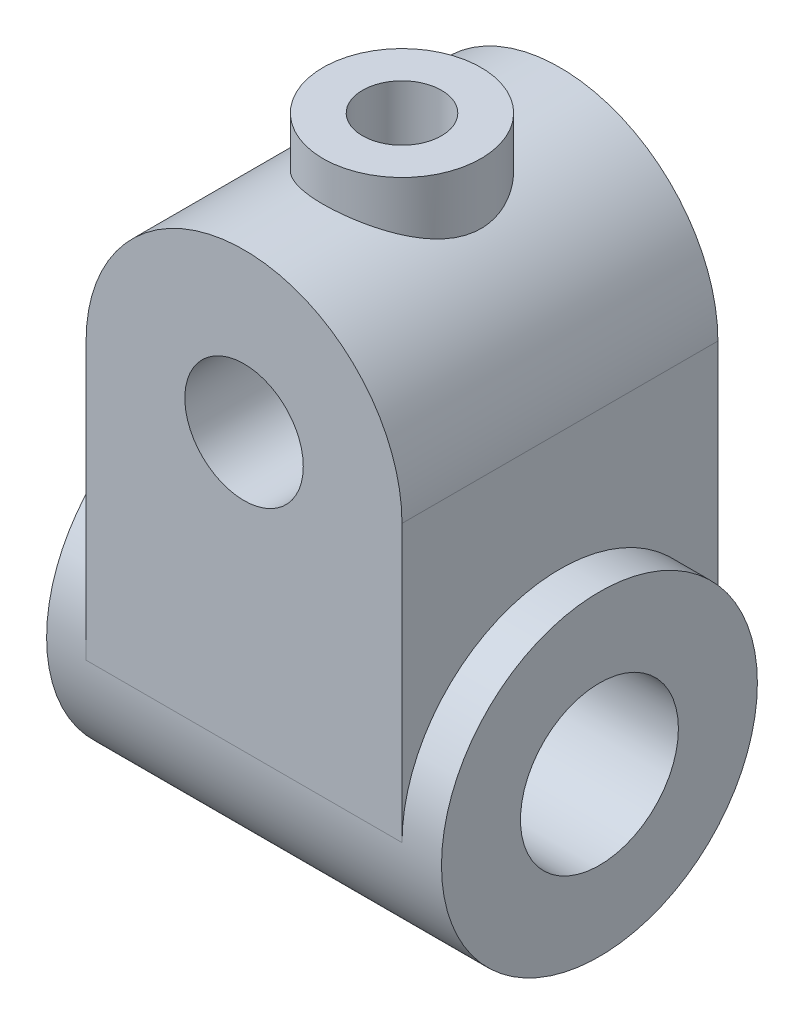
ISO-10303-21;
HEADER;
FILE_DESCRIPTION(('STEP AP214'),'2;1');
FILE_NAME('part.step','',(''),(''),'','','');
FILE_SCHEMA(('AUTOMOTIVE_DESIGN { 1 0 10303 214 1 1 1 1 }'));
ENDSEC;
DATA;
#1=APPLICATION_CONTEXT('core data for automotive mechanical design processes');
#2=APPLICATION_PROTOCOL_DEFINITION('international standard','automotive_design',2000,#1);
#3=PRODUCT_CONTEXT('',#1,'mechanical');
#4=PRODUCT('Part','Part','',(#3));
#5=PRODUCT_RELATED_PRODUCT_CATEGORY('part','',(#4));
#6=PRODUCT_DEFINITION_FORMATION('','',#4);
#7=PRODUCT_DEFINITION_CONTEXT('part definition',#1,'design');
#8=PRODUCT_DEFINITION('design','',#6,#7);
#9=PRODUCT_DEFINITION_SHAPE('','',#8);
#10=(LENGTH_UNIT() NAMED_UNIT(*) SI_UNIT(.MILLI.,.METRE.));
#11=(NAMED_UNIT(*) PLANE_ANGLE_UNIT() SI_UNIT($,.RADIAN.));
#12=(NAMED_UNIT(*) SI_UNIT($,.STERADIAN.) SOLID_ANGLE_UNIT());
#13=UNCERTAINTY_MEASURE_WITH_UNIT(LENGTH_MEASURE(1.E-05),#10,'distance_accuracy_value','');
#14=(GEOMETRIC_REPRESENTATION_CONTEXT(3) GLOBAL_UNCERTAINTY_ASSIGNED_CONTEXT((#13)) GLOBAL_UNIT_ASSIGNED_CONTEXT((#10,
#11,#12)) REPRESENTATION_CONTEXT('',''));
#15=CARTESIAN_POINT('',(0.,0.,0.));
#16=DIRECTION('',(0.,0.,1.));
#17=DIRECTION('',(1.,0.,0.));
#18=AXIS2_PLACEMENT_3D('',#15,#16,#17);
#19=CARTESIAN_POINT('',(0.,70.,40.));
#20=DIRECTION('',(1.,0.,0.));
#21=DIRECTION('',(0.,0.,-1.));
#22=AXIS2_PLACEMENT_3D('',#19,#20,#21);
#23=PLANE('',#22);
#24=CARTESIAN_POINT('',(0.,0.,0.));
#25=DIRECTION('',(1.,0.,0.));
#26=DIRECTION('',(0.,0.,-1.));
#27=AXIS2_PLACEMENT_3D('',#24,#25,#26);
#28=CIRCLE('',#27,40.);
#29=CARTESIAN_POINT('',(0.,0.,40.));
#30=VERTEX_POINT('',#29);
#31=CARTESIAN_POINT('',(0.,0.,-40.));
#32=VERTEX_POINT('',#31);
#33=EDGE_CURVE('E78',#30,#32,#28,.F.);
#34=ORIENTED_EDGE('',*,*,#33,.F.);
#35=DIRECTION('',(0.,-1.,0.));
#36=VECTOR('',#35,1.);
#37=CARTESIAN_POINT('',(0.,70.,40.));
#38=LINE('',#37,#36);
#39=CARTESIAN_POINT('',(0.,70.,40.));
#40=VERTEX_POINT('',#39);
#41=EDGE_CURVE('E89',#40,#30,#38,.T.);
#42=ORIENTED_EDGE('',*,*,#41,.F.);
#43=DIRECTION('',(0.,0.,-1.));
#44=VECTOR('',#43,1.);
#45=CARTESIAN_POINT('',(0.,70.,40.));
#46=LINE('',#45,#44);
#47=CARTESIAN_POINT('',(0.,70.,-40.));
#48=VERTEX_POINT('',#47);
#49=EDGE_CURVE('E105',#40,#48,#46,.T.);
#50=ORIENTED_EDGE('',*,*,#49,.T.);
#51=DIRECTION('',(0.,-1.,0.));
#52=VECTOR('',#51,1.);
#53=CARTESIAN_POINT('',(0.,70.,-40.));
#54=LINE('',#53,#52);
#55=EDGE_CURVE('E97',#48,#32,#54,.T.);
#56=ORIENTED_EDGE('',*,*,#55,.T.);
#57=EDGE_LOOP('',(#34,#42,#50,#56));
#58=FACE_BOUND('',#57,.T.);
#59=ADVANCED_FACE('F33',(#58),#23,.F.);
#60=CARTESIAN_POINT('',(80.,0.,40.));
#61=DIRECTION('',(-1.,0.,0.));
#62=DIRECTION('',(0.,0.,1.));
#63=AXIS2_PLACEMENT_3D('',#60,#61,#62);
#64=PLANE('',#63);
#65=CARTESIAN_POINT('',(80.,0.,0.));
#66=DIRECTION('',(-1.,0.,0.));
#67=DIRECTION('',(0.,0.,1.));
#68=AXIS2_PLACEMENT_3D('',#65,#66,#67);
#69=CIRCLE('',#68,40.);
#70=CARTESIAN_POINT('',(80.,0.,-40.));
#71=VERTEX_POINT('',#70);
#72=CARTESIAN_POINT('',(80.,0.,40.));
#73=VERTEX_POINT('',#72);
#74=EDGE_CURVE('E12',#71,#73,#69,.F.);
#75=ORIENTED_EDGE('',*,*,#74,.F.);
#76=DIRECTION('',(0.,1.,0.));
#77=VECTOR('',#76,1.);
#78=CARTESIAN_POINT('',(80.,0.,-40.));
#79=LINE('',#78,#77);
#80=CARTESIAN_POINT('',(80.,70.,-40.));
#81=VERTEX_POINT('',#80);
#82=EDGE_CURVE('E66',#71,#81,#79,.T.);
#83=ORIENTED_EDGE('',*,*,#82,.T.);
#84=DIRECTION('',(0.,0.,-1.));
#85=VECTOR('',#84,1.);
#86=CARTESIAN_POINT('',(80.,70.,40.));
#87=LINE('',#86,#85);
#88=CARTESIAN_POINT('',(80.,70.,40.));
#89=VERTEX_POINT('',#88);
#90=EDGE_CURVE('E41',#89,#81,#87,.T.);
#91=ORIENTED_EDGE('',*,*,#90,.F.);
#92=DIRECTION('',(0.,1.,0.));
#93=VECTOR('',#92,1.);
#94=CARTESIAN_POINT('',(80.,0.,40.));
#95=LINE('',#94,#93);
#96=EDGE_CURVE('E81',#73,#89,#95,.T.);
#97=ORIENTED_EDGE('',*,*,#96,.F.);
#98=EDGE_LOOP('',(#75,#83,#91,#97));
#99=FACE_BOUND('',#98,.T.);
#100=ADVANCED_FACE('F83',(#99),#64,.F.);
#101=CARTESIAN_POINT('',(40.,70.,40.));
#102=DIRECTION('',(0.,0.,1.));
#103=DIRECTION('',(1.,0.,0.));
#104=AXIS2_PLACEMENT_3D('',#101,#102,#103);
#105=PLANE('',#104);
#106=ORIENTED_EDGE('',*,*,#41,.T.);
#107=DIRECTION('',(1.,0.,0.));
#108=VECTOR('',#107,1.);
#109=CARTESIAN_POINT('',(0.,0.,40.));
#110=LINE('',#109,#108);
#111=EDGE_CURVE('E84',#30,#73,#110,.T.);
#112=ORIENTED_EDGE('',*,*,#111,.T.);
#113=ORIENTED_EDGE('',*,*,#96,.T.);
#114=CARTESIAN_POINT('',(40.,70.,40.));
#115=DIRECTION('',(0.,0.,1.));
#116=DIRECTION('',(1.,0.,0.));
#117=AXIS2_PLACEMENT_3D('',#114,#115,#116);
#118=CIRCLE('',#117,40.);
#119=EDGE_CURVE('E49',#89,#40,#118,.T.);
#120=ORIENTED_EDGE('',*,*,#119,.T.);
#121=EDGE_LOOP('',(#106,#112,#113,#120));
#122=FACE_BOUND('',#121,.T.);
#123=CARTESIAN_POINT('',(40.,70.,40.));
#124=DIRECTION('',(0.,0.,1.));
#125=DIRECTION('',(1.,0.,0.));
#126=AXIS2_PLACEMENT_3D('',#123,#124,#125);
#127=CIRCLE('',#126,15.);
#128=CARTESIAN_POINT('',(55.,70.,40.));
#129=VERTEX_POINT('',#128);
#130=EDGE_CURVE('E100',#129,#129,#127,.T.);
#131=ORIENTED_EDGE('',*,*,#130,.F.);
#132=EDGE_LOOP('',(#131));
#133=FACE_BOUND('',#132,.T.);
#134=ADVANCED_FACE('F87',(#122,#133),#105,.T.);
#135=CARTESIAN_POINT('',(40.,70.,-40.));
#136=DIRECTION('',(0.,0.,1.));
#137=DIRECTION('',(1.,0.,0.));
#138=AXIS2_PLACEMENT_3D('',#135,#136,#137);
#139=PLANE('',#138);
#140=ORIENTED_EDGE('',*,*,#55,.F.);
#141=CARTESIAN_POINT('',(40.,70.,-40.));
#142=DIRECTION('',(0.,0.,1.));
#143=DIRECTION('',(1.,0.,0.));
#144=AXIS2_PLACEMENT_3D('',#141,#142,#143);
#145=CIRCLE('',#144,40.);
#146=EDGE_CURVE('E71',#81,#48,#145,.T.);
#147=ORIENTED_EDGE('',*,*,#146,.F.);
#148=ORIENTED_EDGE('',*,*,#82,.F.);
#149=DIRECTION('',(1.,0.,0.));
#150=VECTOR('',#149,1.);
#151=CARTESIAN_POINT('',(0.,0.,-40.));
#152=LINE('',#151,#150);
#153=EDGE_CURVE('E94',#32,#71,#152,.T.);
#154=ORIENTED_EDGE('',*,*,#153,.F.);
#155=EDGE_LOOP('',(#140,#147,#148,#154));
#156=FACE_BOUND('',#155,.T.);
#157=CARTESIAN_POINT('',(40.,70.,-40.));
#158=DIRECTION('',(0.,0.,1.));
#159=DIRECTION('',(1.,0.,0.));
#160=AXIS2_PLACEMENT_3D('',#157,#158,#159);
#161=CIRCLE('',#160,15.);
#162=CARTESIAN_POINT('',(55.,70.,-40.));
#163=VERTEX_POINT('',#162);
#164=EDGE_CURVE('E111',#163,#163,#161,.T.);
#165=ORIENTED_EDGE('',*,*,#164,.T.);
#166=EDGE_LOOP('',(#165));
#167=FACE_BOUND('',#166,.T.);
#168=ADVANCED_FACE('F107',(#156,#167),#139,.F.);
#169=CARTESIAN_POINT('',(40.,70.,40.));
#170=DIRECTION('',(0.,0.,-1.));
#171=DIRECTION('',(-1.,0.,0.));
#172=AXIS2_PLACEMENT_3D('',#169,#170,#171);
#173=CYLINDRICAL_SURFACE('',#172,40.);
#174=CARTESIAN_POINT('',(40.,109.999999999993,20.));
#175=CARTESIAN_POINT('',(40.5259554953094,109.999998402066,19.9999982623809));
#176=CARTESIAN_POINT('',(41.0519477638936,109.989602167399,19.9792289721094));
#177=CARTESIAN_POINT('',(42.1000584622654,109.948279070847,19.8963883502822));
#178=CARTESIAN_POINT('',(42.6221751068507,109.917343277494,19.8342990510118));
#179=CARTESIAN_POINT('',(43.6592645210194,109.835672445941,19.6694161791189));
#180=CARTESIAN_POINT('',(44.1742237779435,109.784904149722,19.5665542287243));
#181=CARTESIAN_POINT('',(45.1923636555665,109.664872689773,19.3213235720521));
#182=CARTESIAN_POINT('',(45.695545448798,109.595611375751,19.1789588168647));
#183=CARTESIAN_POINT('',(46.6849367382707,109.440606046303,18.856861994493));
#184=CARTESIAN_POINT('',(47.1712049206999,109.354927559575,18.6772782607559));
#185=CARTESIAN_POINT('',(48.1259686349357,109.168931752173,18.2821113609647));
#186=CARTESIAN_POINT('',(48.5944637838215,109.068614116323,18.0665274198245));
#187=CARTESIAN_POINT('',(49.5110978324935,108.855635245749,17.6012260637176));
#188=CARTESIAN_POINT('',(49.9592411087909,108.742976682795,17.3515160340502));
#189=CARTESIAN_POINT('',(50.8331914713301,108.507749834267,16.8197401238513));
#190=CARTESIAN_POINT('',(51.2589965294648,108.385180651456,16.5376713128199));
#191=CARTESIAN_POINT('',(52.111428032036,108.125105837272,15.9249873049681));
#192=CARTESIAN_POINT('',(52.5365475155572,107.987145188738,15.5924680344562));
#193=CARTESIAN_POINT('',(53.3576238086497,107.706261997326,14.8951014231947));
#194=CARTESIAN_POINT('',(53.7535796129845,107.563339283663,14.5302529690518));
#195=CARTESIAN_POINT('',(54.5147245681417,107.275841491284,13.7699763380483));
#196=CARTESIAN_POINT('',(54.8798984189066,107.131265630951,13.3745331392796));
#197=CARTESIAN_POINT('',(55.5776736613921,106.843975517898,12.5549154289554));
#198=CARTESIAN_POINT('',(55.9102597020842,106.701262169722,12.1307275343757));
#199=CARTESIAN_POINT('',(56.5654339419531,106.410501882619,11.2215973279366));
#200=CARTESIAN_POINT('',(56.8852333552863,106.262903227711,10.7344956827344));
#201=CARTESIAN_POINT('',(57.4822019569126,105.978908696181,9.7320475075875));
#202=CARTESIAN_POINT('',(57.7593921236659,105.842507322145,9.21671504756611));
#203=CARTESIAN_POINT('',(58.268775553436,105.58557632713,8.16060160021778));
#204=CARTESIAN_POINT('',(58.50098089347,105.465042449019,7.61982749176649));
#205=CARTESIAN_POINT('',(58.9178904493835,105.244419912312,6.51622809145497));
#206=CARTESIAN_POINT('',(59.1025999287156,105.144328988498,5.95340525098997));
#207=CARTESIAN_POINT('',(59.4125091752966,104.974045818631,4.8441699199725));
#208=CARTESIAN_POINT('',(59.5406061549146,104.902424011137,4.29878748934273));
#209=CARTESIAN_POINT('',(59.7508644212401,104.783875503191,3.19656707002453));
#210=CARTESIAN_POINT('',(59.8330276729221,104.736947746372,2.63972957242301));
#211=CARTESIAN_POINT('',(59.9500955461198,104.669846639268,1.51997079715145));
#212=CARTESIAN_POINT('',(59.9850401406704,104.649650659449,0.957055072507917));
#213=CARTESIAN_POINT('',(60.007216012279,104.636851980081,-0.170005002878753));
#214=CARTESIAN_POINT('',(59.9944518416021,104.644246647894,-0.734149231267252));
#215=CARTESIAN_POINT('',(59.9258258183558,104.683752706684,-1.79091472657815));
#216=CARTESIAN_POINT('',(59.8753086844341,104.712797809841,-2.28400999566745));
#217=CARTESIAN_POINT('',(59.7381397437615,104.790976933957,-3.26348526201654));
#218=CARTESIAN_POINT('',(59.6514913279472,104.840109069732,-3.74986588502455));
#219=CARTESIAN_POINT('',(59.4430371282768,104.95686683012,-4.71286681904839));
#220=CARTESIAN_POINT('',(59.3212225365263,105.024497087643,-5.18948465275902));
#221=CARTESIAN_POINT('',(59.0437058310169,105.176160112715,-6.13006796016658));
#222=CARTESIAN_POINT('',(58.8880019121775,105.260193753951,-6.59403275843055));
#223=CARTESIAN_POINT('',(58.5401581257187,105.444352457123,-7.51741518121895));
#224=CARTESIAN_POINT('',(58.3472621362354,105.54480336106,-7.97648237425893));
#225=CARTESIAN_POINT('',(57.9289653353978,105.757618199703,-8.87686508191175));
#226=CARTESIAN_POINT('',(57.7035528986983,105.86998639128,-9.31817417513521));
#227=CARTESIAN_POINT('',(57.221745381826,106.103783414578,-10.1811473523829));
#228=CARTESIAN_POINT('',(56.9653434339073,106.225214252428,-10.6028070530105));
#229=CARTESIAN_POINT('',(56.423079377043,106.474257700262,-11.4247489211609));
#230=CARTESIAN_POINT('',(56.137218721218,106.601870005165,-11.8250321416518));
#231=CARTESIAN_POINT('',(55.4992958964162,106.876920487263,-12.6521986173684));
#232=CARTESIAN_POINT('',(55.1434365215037,107.024818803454,-13.0760069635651));
#233=CARTESIAN_POINT('',(54.3979314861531,107.321045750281,-13.8926336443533));
#234=CARTESIAN_POINT('',(54.0082842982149,107.469374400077,-14.2854505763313));
#235=CARTESIAN_POINT('',(53.1968254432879,107.762812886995,-15.0382941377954));
#236=CARTESIAN_POINT('',(52.7749919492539,107.907920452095,-15.3982981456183));
#237=CARTESIAN_POINT('',(51.9015900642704,108.191135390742,-16.0829073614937));
#238=CARTESIAN_POINT('',(51.4500336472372,108.329245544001,-16.4075266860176));
#239=CARTESIAN_POINT('',(50.4974553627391,108.60129606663,-17.0335917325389));
#240=CARTESIAN_POINT('',(49.9951074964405,108.734738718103,-17.3332416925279));
#241=CARTESIAN_POINT('',(48.963059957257,108.986480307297,-17.8887384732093));
#242=CARTESIAN_POINT('',(48.4333590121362,109.104778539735,-18.1445832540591));
#243=CARTESIAN_POINT('',(47.3505204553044,109.32269846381,-18.6095886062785));
#244=CARTESIAN_POINT('',(46.7973980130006,109.42233202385,-18.818778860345));
#245=CARTESIAN_POINT('',(45.6716452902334,109.599962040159,-19.1881015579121));
#246=CARTESIAN_POINT('',(45.0990172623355,109.677960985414,-19.3482396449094));
#247=CARTESIAN_POINT('',(43.9872016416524,109.804382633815,-19.6061317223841));
#248=CARTESIAN_POINT('',(43.4491731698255,109.854720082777,-19.7079544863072));
#249=CARTESIAN_POINT('',(42.3650118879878,109.93372050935,-19.8672303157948));
#250=CARTESIAN_POINT('',(41.8188795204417,109.962384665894,-19.9246857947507));
#251=CARTESIAN_POINT('',(40.7232429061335,109.997215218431,-19.9944526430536));
#252=CARTESIAN_POINT('',(40.1737400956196,110.003390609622,-20.0067820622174));
#253=CARTESIAN_POINT('',(39.0758094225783,109.993089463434,-19.9861776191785));
#254=CARTESIAN_POINT('',(38.5273815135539,109.976613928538,-19.9532457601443));
#255=CARTESIAN_POINT('',(37.4786084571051,109.923634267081,-19.8468758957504));
#256=CARTESIAN_POINT('',(36.9778357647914,109.888784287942,-19.7767809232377));
#257=CARTESIAN_POINT('',(35.9845932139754,109.801068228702,-19.5992599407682));
#258=CARTESIAN_POINT('',(35.492122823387,109.748203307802,-19.4918363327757));
#259=CARTESIAN_POINT('',(34.5186314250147,109.625690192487,-19.2407722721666));
#260=CARTESIAN_POINT('',(34.0376110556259,109.556041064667,-19.0971298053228));
#261=CARTESIAN_POINT('',(33.0898970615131,109.401535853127,-18.7750097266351));
#262=CARTESIAN_POINT('',(32.6232040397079,109.316679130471,-18.5965306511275));
#263=CARTESIAN_POINT('',(31.6936008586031,109.130994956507,-18.2007191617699));
#264=CARTESIAN_POINT('',(31.2311785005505,109.029780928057,-17.9824235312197));
#265=CARTESIAN_POINT('',(30.326550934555,108.815467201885,-17.5124022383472));
#266=CARTESIAN_POINT('',(29.8843459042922,108.702367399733,-17.2606762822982));
#267=CARTESIAN_POINT('',(29.0220526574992,108.46666770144,-16.7254970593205));
#268=CARTESIAN_POINT('',(28.6019713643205,108.34406486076,-16.4420339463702));
#269=CARTESIAN_POINT('',(27.7858181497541,108.091944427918,-15.8451696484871));
#270=CARTESIAN_POINT('',(27.3897483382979,107.962426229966,-15.5317658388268));
#271=CARTESIAN_POINT('',(26.5855515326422,107.686212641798,-14.8444984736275));
#272=CARTESIAN_POINT('',(26.1800620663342,107.539079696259,-14.4677200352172));
#273=CARTESIAN_POINT('',(25.4019120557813,107.243376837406,-13.6821610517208));
#274=CARTESIAN_POINT('',(25.0292535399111,107.094806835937,-13.2733785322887));
#275=CARTESIAN_POINT('',(24.3185097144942,106.799985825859,-12.425656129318));
#276=CARTESIAN_POINT('',(23.9804398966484,106.653735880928,-11.9867028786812));
#277=CARTESIAN_POINT('',(23.3408603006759,106.367511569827,-11.0806458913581));
#278=CARTESIAN_POINT('',(23.0393678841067,106.227540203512,-10.6135289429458));
#279=CARTESIAN_POINT('',(22.4614329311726,105.951442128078,-9.63013638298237));
#280=CARTESIAN_POINT('',(22.186924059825,105.815834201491,-9.11257468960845));
#281=CARTESIAN_POINT('',(21.6832269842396,105.560870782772,-8.05233179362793));
#282=CARTESIAN_POINT('',(21.4540134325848,105.441506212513,-7.5096648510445));
#283=CARTESIAN_POINT('',(21.0434464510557,105.223615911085,-6.4029008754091));
#284=CARTESIAN_POINT('',(20.8620564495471,105.125074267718,-5.83882059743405));
#285=CARTESIAN_POINT('',(20.5493981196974,104.952912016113,-4.69323340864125));
#286=CARTESIAN_POINT('',(20.4181220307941,104.87928754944,-4.1117292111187));
#287=CARTESIAN_POINT('',(20.2178487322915,104.766052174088,-2.99295044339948));
#288=CARTESIAN_POINT('',(20.1440828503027,104.723854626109,-2.45678849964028));
#289=CARTESIAN_POINT('',(20.0402461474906,104.664273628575,-1.37887867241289));
#290=CARTESIAN_POINT('',(20.0101723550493,104.646888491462,-0.837131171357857));
#291=CARTESIAN_POINT('',(19.9941806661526,104.63765684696,0.247027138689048));
#292=CARTESIAN_POINT('',(20.0082464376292,104.645800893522,0.789437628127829));
#293=CARTESIAN_POINT('',(20.0802820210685,104.687267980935,1.87034420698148));
#294=CARTESIAN_POINT('',(20.138250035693,104.720589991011,2.40884045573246));
#295=CARTESIAN_POINT('',(20.2896203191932,104.806718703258,3.42632818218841));
#296=CARTESIAN_POINT('',(20.3791121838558,104.85736196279,3.90609324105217));
#297=CARTESIAN_POINT('',(20.592285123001,104.976499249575,4.85565155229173));
#298=CARTESIAN_POINT('',(20.715963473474,105.044991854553,5.32544559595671));
#299=CARTESIAN_POINT('',(20.9962842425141,105.197787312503,6.25246548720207));
#300=CARTESIAN_POINT('',(21.1529293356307,105.282091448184,6.70969031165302));
#301=CARTESIAN_POINT('',(21.4978706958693,105.464196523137,7.60943192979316));
#302=CARTESIAN_POINT('',(21.6861786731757,105.562002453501,8.05194320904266));
#303=CARTESIAN_POINT('',(22.1066410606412,105.775507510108,8.94926640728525));
#304=CARTESIAN_POINT('',(22.3408874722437,105.891966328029,9.40291703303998));
#305=CARTESIAN_POINT('',(22.8421088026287,106.134252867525,10.2891181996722));
#306=CARTESIAN_POINT('',(23.1090845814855,106.260080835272,10.7216681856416));
#307=CARTESIAN_POINT('',(23.6743412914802,106.518069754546,11.5641839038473));
#308=CARTESIAN_POINT('',(23.9726401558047,106.650234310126,11.974136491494));
#309=CARTESIAN_POINT('',(24.5988193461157,106.917739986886,12.7694857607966));
#310=CARTESIAN_POINT('',(24.926692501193,107.053080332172,13.1548883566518));
#311=CARTESIAN_POINT('',(25.6523225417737,107.340519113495,13.9451011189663));
#312=CARTESIAN_POINT('',(26.053727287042,107.492651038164,14.3465583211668));
#313=CARTESIAN_POINT('',(26.8899970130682,107.793190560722,15.114567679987));
#314=CARTESIAN_POINT('',(27.324864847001,107.941597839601,15.4811168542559));
#315=CARTESIAN_POINT('',(28.2261325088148,108.230879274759,16.1771564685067));
#316=CARTESIAN_POINT('',(28.6925508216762,108.371748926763,16.5066248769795));
#317=CARTESIAN_POINT('',(29.654209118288,108.642127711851,17.1257582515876));
#318=CARTESIAN_POINT('',(30.1494474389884,108.771637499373,17.4154255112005));
#319=CARTESIAN_POINT('',(31.1695552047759,109.016667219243,17.9543405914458));
#320=CARTESIAN_POINT('',(31.6946112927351,109.132080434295,18.2032844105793));
#321=CARTESIAN_POINT('',(32.7677039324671,109.344542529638,18.6556405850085));
#322=CARTESIAN_POINT('',(33.315743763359,109.441588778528,18.859046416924));
#323=CARTESIAN_POINT('',(34.4292109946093,109.614175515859,19.2173750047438));
#324=CARTESIAN_POINT('',(34.9945911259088,109.689769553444,19.3724185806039));
#325=CARTESIAN_POINT('',(36.1390535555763,109.817385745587,19.6325521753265));
#326=CARTESIAN_POINT('',(36.7181272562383,109.869422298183,19.737672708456));
#327=CARTESIAN_POINT('',(37.7478329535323,109.939055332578,19.8778978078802));
#328=CARTESIAN_POINT('',(38.1966966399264,109.961869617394,19.9236469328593));
#329=CARTESIAN_POINT('',(39.0970311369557,109.992342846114,19.9846991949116));
#330=CARTESIAN_POINT('',(39.5485020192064,110.000001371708,20.000001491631));
#331=CARTESIAN_POINT('',(40.,109.999999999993,20.));
#332=B_SPLINE_CURVE_WITH_KNOTS('',3,(#174,#175,#176,#177,#178,#179,#180,#181,#182,#183,#184,
#185,#186,#187,#188,#189,#190,#191,#192,#193,#194,#195,#196,#197,#198,#199,#200,#201,#202,#203,
#204,#205,#206,#207,#208,#209,#210,#211,#212,#213,#214,#215,#216,#217,#218,#219,#220,#221,#222,
#223,#224,#225,#226,#227,#228,#229,#230,#231,#232,#233,#234,#235,#236,#237,#238,#239,#240,#241,
#242,#243,#244,#245,#246,#247,#248,#249,#250,#251,#252,#253,#254,#255,#256,#257,#258,#259,#260,
#261,#262,#263,#264,#265,#266,#267,#268,#269,#270,#271,#272,#273,#274,#275,#276,#277,#278,#279,
#280,#281,#282,#283,#284,#285,#286,#287,#288,#289,#290,#291,#292,#293,#294,#295,#296,#297,#298,
#299,#300,#301,#302,#303,#304,#305,#306,#307,#308,#309,#310,#311,#312,#313,#314,#315,#316,#317,
#318,#319,#320,#321,#322,#323,#324,#325,#326,#327,#328,#329,#330,#331),.UNSPECIFIED.,.T.,.F.,(4,
2,2,2,2,2,2,2,2,2,2,2,2,2,2,2,2,2,2,2,2,2,2,2,2,2,2,2,2,2,2,2,2,2,2,2,2,2,2,2,2,2,2,2,2,2,2,2,2,
2,2,2,2,2,2,2,2,2,2,2,2,2,2,2,2,2,2,2,2,2,2,2,2,2,2,2,2,2,4),(0.,1.57742117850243,
3.15552873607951,4.73629413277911,6.31690147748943,7.89132656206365,9.4657855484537,
11.0399043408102,12.6141658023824,14.2836111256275,15.9531139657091,17.6234417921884,
19.2945527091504,21.0956182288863,22.8957941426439,24.6954860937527,26.4949785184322,
28.1869064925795,29.878762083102,31.5691845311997,33.2594456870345,34.7472712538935,
36.2349572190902,37.7230161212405,39.2111543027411,40.7335431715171,42.2564776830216,
43.7797503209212,45.3029478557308,47.0195294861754,48.7361887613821,50.4540227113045,
52.1711688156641,53.9686851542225,55.7662851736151,57.5627382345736,59.3589845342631,
61.0064389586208,62.6538037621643,64.3005095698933,65.9471425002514,67.4659444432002,
68.9846486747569,70.5034373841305,72.0222899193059,73.5844756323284,75.1466750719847,
76.7093605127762,78.2721830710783,79.9885258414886,81.7049745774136,83.4221887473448,
85.1402148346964,86.9418674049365,88.7425088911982,90.5417693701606,92.3407511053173,
93.9670431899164,95.5932246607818,97.218804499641,98.8443177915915,100.31467320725,
101.784911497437,103.255269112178,104.726171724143,106.295593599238,107.865056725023,
109.435423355,111.005410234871,112.766606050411,114.527952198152,116.290339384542,
118.052624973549,119.827518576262,121.602666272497,123.373343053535,125.142936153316,
126.49701045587,127.851122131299),.UNSPECIFIED.);
#333=CARTESIAN_POINT('',(40.,109.999999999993,20.));
#334=VERTEX_POINT('',#333);
#335=EDGE_CURVE('E130',#334,#334,#332,.T.);
#336=ORIENTED_EDGE('',*,*,#335,.F.);
#337=EDGE_LOOP('',(#336));
#338=FACE_BOUND('',#337,.T.);
#339=ORIENTED_EDGE('',*,*,#146,.T.);
#340=ORIENTED_EDGE('',*,*,#49,.F.);
#341=ORIENTED_EDGE('',*,*,#119,.F.);
#342=ORIENTED_EDGE('',*,*,#90,.T.);
#343=EDGE_LOOP('',(#339,#340,#341,#342));
#344=FACE_BOUND('',#343,.T.);
#345=ADVANCED_FACE('F106',(#338,#344),#173,.T.);
#346=CARTESIAN_POINT('',(40.,70.,40.));
#347=DIRECTION('',(0.,0.,-1.));
#348=DIRECTION('',(-1.,0.,0.));
#349=AXIS2_PLACEMENT_3D('',#346,#347,#348);
#350=CYLINDRICAL_SURFACE('',#349,15.);
#351=CARTESIAN_POINT('',(40.,85.,9.99999999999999));
#352=CARTESIAN_POINT('',(40.251216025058,84.9999999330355,9.9999999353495));
#353=CARTESIAN_POINT('',(40.5024332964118,84.9936756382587,9.99052094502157));
#354=CARTESIAN_POINT('',(41.0028143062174,84.968537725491,9.95275435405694));
#355=CARTESIAN_POINT('',(41.2519780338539,84.949724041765,9.92446665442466));
#356=CARTESIAN_POINT('',(41.7463943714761,84.900062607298,9.84950014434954));
#357=CARTESIAN_POINT('',(41.9916454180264,84.8692101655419,9.80281416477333));
#358=CARTESIAN_POINT('',(42.476368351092,84.7962049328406,9.69171976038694));
#359=CARTESIAN_POINT('',(42.7158401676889,84.7540520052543,9.62731112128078));
#360=CARTESIAN_POINT('',(43.1863415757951,84.6596225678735,9.48196024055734));
#361=CARTESIAN_POINT('',(43.4174060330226,84.6073953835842,9.40109845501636));
#362=CARTESIAN_POINT('',(43.8710353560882,84.4937836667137,9.22357931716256));
#363=CARTESIAN_POINT('',(44.0936002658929,84.4323991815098,9.12692204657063));
#364=CARTESIAN_POINT('',(44.5291923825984,84.3016824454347,8.91878234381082));
#365=CARTESIAN_POINT('',(44.7422211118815,84.2323514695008,8.80730228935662));
#366=CARTESIAN_POINT('',(45.1580689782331,84.0869750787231,8.57039192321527));
#367=CARTESIAN_POINT('',(45.3608842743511,84.0109271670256,8.44495641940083));
#368=CARTESIAN_POINT('',(45.772291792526,83.846795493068,8.16988010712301));
#369=CARTESIAN_POINT('',(45.9799261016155,83.7582376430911,8.01908981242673));
#370=CARTESIAN_POINT('',(46.3818623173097,83.5764689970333,7.70306611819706));
#371=CARTESIAN_POINT('',(46.576158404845,83.4832562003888,7.53782648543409));
#372=CARTESIAN_POINT('',(46.9510916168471,83.2938516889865,7.19355182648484));
#373=CARTESIAN_POINT('',(47.1317102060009,83.1976561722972,7.01449872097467));
#374=CARTESIAN_POINT('',(47.4784934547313,83.0042893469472,6.6435373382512));
#375=CARTESIAN_POINT('',(47.6446627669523,82.9071183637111,6.45163323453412));
#376=CARTESIAN_POINT('',(47.9872708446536,82.6984183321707,6.02411381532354));
#377=CARTESIAN_POINT('',(48.1611793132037,82.5870482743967,5.78638467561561));
#378=CARTESIAN_POINT('',(48.4882438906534,82.3688469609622,5.29498288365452));
#379=CARTESIAN_POINT('',(48.6413952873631,82.2620167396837,5.04130663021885));
#380=CARTESIAN_POINT('',(48.925545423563,82.0567536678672,4.51916377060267));
#381=CARTESIAN_POINT('',(49.0565798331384,81.958307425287,4.25072192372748));
#382=CARTESIAN_POINT('',(49.2953668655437,81.7736552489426,3.69950149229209));
#383=CARTESIAN_POINT('',(49.4031186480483,81.6874497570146,3.41672239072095));
#384=CARTESIAN_POINT('',(49.566030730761,81.554164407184,2.92197512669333));
#385=CARTESIAN_POINT('',(49.6273926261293,81.5029747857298,2.71313958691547));
#386=CARTESIAN_POINT('',(49.7367294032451,81.4105753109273,2.289937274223));
#387=CARTESIAN_POINT('',(49.784712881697,81.3693590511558,2.07557415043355));
#388=CARTESIAN_POINT('',(49.8666311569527,81.2983421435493,1.64258097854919));
#389=CARTESIAN_POINT('',(49.9005833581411,81.2685273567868,1.42395657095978));
#390=CARTESIAN_POINT('',(49.9539809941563,81.221387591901,0.983588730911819));
#391=CARTESIAN_POINT('',(49.9734263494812,81.204062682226,0.761845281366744));
#392=CARTESIAN_POINT('',(49.9975094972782,81.1825789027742,0.315986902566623));
#393=CARTESIAN_POINT('',(50.0020856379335,81.1784748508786,0.0918659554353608));
#394=CARTESIAN_POINT('',(49.9961699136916,81.1837650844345,-0.356015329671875));
#395=CARTESIAN_POINT('',(49.9856779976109,81.1931594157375,-0.579775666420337));
#396=CARTESIAN_POINT('',(49.9498102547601,81.2250543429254,-1.02531254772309));
#397=CARTESIAN_POINT('',(49.9244233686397,81.2475646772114,-1.24708749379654));
#398=CARTESIAN_POINT('',(49.8592009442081,81.3047790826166,-1.68688746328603));
#399=CARTESIAN_POINT('',(49.8193651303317,81.3394833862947,-1.90491241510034));
#400=CARTESIAN_POINT('',(49.7279332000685,81.4180019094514,-2.32630776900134));
#401=CARTESIAN_POINT('',(49.6769396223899,81.4613417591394,-2.52989845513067));
#402=CARTESIAN_POINT('',(49.5629080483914,81.5566568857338,-2.93162712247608));
#403=CARTESIAN_POINT('',(49.4998659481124,81.6086351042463,-3.12976321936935));
#404=CARTESIAN_POINT('',(49.2935449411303,81.7754502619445,-3.71496532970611));
#405=CARTESIAN_POINT('',(49.1330236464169,81.9012104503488,-4.09304089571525));
#406=CARTESIAN_POINT('',(48.8427215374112,82.1171285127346,-4.67614375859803));
#407=CARTESIAN_POINT('',(48.7261278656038,82.2015387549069,-4.89016265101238));
#408=CARTESIAN_POINT('',(48.4785240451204,82.3748717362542,-5.30787405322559));
#409=CARTESIAN_POINT('',(48.3475125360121,82.4637949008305,-5.51156558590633));
#410=CARTESIAN_POINT('',(48.0715274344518,82.6442740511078,-5.90837865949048));
#411=CARTESIAN_POINT('',(47.9265385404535,82.7358328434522,-6.10148824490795));
#412=CARTESIAN_POINT('',(47.6231772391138,82.9196994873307,-6.4765218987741));
#413=CARTESIAN_POINT('',(47.4648041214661,83.0120073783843,-6.65844537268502));
#414=CARTESIAN_POINT('',(47.099474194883,83.2155248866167,-7.04865159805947));
#415=CARTESIAN_POINT('',(46.8894079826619,83.3265151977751,-7.25415168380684));
#416=CARTESIAN_POINT('',(46.4507338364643,83.5442982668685,-7.64687567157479));
#417=CARTESIAN_POINT('',(46.2221225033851,83.6510902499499,-7.83409620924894));
#418=CARTESIAN_POINT('',(45.7473430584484,83.8576700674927,-8.18875916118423));
#419=CARTESIAN_POINT('',(45.5011880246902,83.9574630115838,-8.35621606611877));
#420=CARTESIAN_POINT('',(44.9922367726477,84.1474838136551,-8.66988260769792));
#421=CARTESIAN_POINT('',(44.7294451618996,84.2377143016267,-8.81609809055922));
#422=CARTESIAN_POINT('',(44.241665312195,84.3895846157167,-9.05909913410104));
#423=CARTESIAN_POINT('',(44.0193627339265,84.4533619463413,-9.15995597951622));
#424=CARTESIAN_POINT('',(43.5659086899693,84.5718625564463,-9.34581764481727));
#425=CARTESIAN_POINT('',(43.3347588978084,84.626587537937,-9.43082544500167));
#426=CARTESIAN_POINT('',(42.8649613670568,84.7258138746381,-9.58399689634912));
#427=CARTESIAN_POINT('',(42.6263185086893,84.7703217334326,-9.65217126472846));
#428=CARTESIAN_POINT('',(42.1428771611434,84.8481652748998,-9.77087619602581));
#429=CARTESIAN_POINT('',(41.8980785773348,84.88150078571,-9.82140648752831));
#430=CARTESIAN_POINT('',(41.4029865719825,84.9363289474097,-9.90428665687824));
#431=CARTESIAN_POINT('',(41.1526737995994,84.9577691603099,-9.93655604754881));
#432=CARTESIAN_POINT('',(40.6495599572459,84.988047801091,-9.98207727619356));
#433=CARTESIAN_POINT('',(40.3967588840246,84.9968862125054,-9.99532908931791));
#434=CARTESIAN_POINT('',(39.8907676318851,85.0017358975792,-10.0026040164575));
#435=CARTESIAN_POINT('',(39.6375774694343,84.9977476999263,-9.99662792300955));
#436=CARTESIAN_POINT('',(39.132909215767,84.9770466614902,-9.96554372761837));
#437=CARTESIAN_POINT('',(38.881431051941,84.9603343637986,-9.94043644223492));
#438=CARTESIAN_POINT('',(38.3997891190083,84.9162207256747,-9.87391563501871));
#439=CARTESIAN_POINT('',(38.1693709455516,84.8896545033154,-9.83377417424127));
#440=CARTESIAN_POINT('',(37.713249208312,84.8264553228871,-9.73781705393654));
#441=CARTESIAN_POINT('',(37.4875453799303,84.7898229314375,-9.68200227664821));
#442=CARTESIAN_POINT('',(37.0421794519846,84.7072292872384,-9.55535953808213));
#443=CARTESIAN_POINT('',(36.8225167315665,84.6612689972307,-9.48453312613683));
#444=CARTESIAN_POINT('',(36.390239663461,84.5608685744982,-9.3285826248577));
#445=CARTESIAN_POINT('',(36.1776280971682,84.5064251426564,-9.24345297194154));
#446=CARTESIAN_POINT('',(35.7479096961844,84.3865364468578,-9.05417659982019));
#447=CARTESIAN_POINT('',(35.5313009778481,84.3206265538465,-8.94919430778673));
#448=CARTESIAN_POINT('',(35.1079180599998,84.1815800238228,-8.72496139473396));
#449=CARTESIAN_POINT('',(34.9011480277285,84.1084403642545,-8.60570480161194));
#450=CARTESIAN_POINT('',(34.4981545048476,83.9562209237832,-8.3538120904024));
#451=CARTESIAN_POINT('',(34.3019336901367,83.877139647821,-8.22117260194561));
#452=CARTESIAN_POINT('',(33.9206004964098,83.7143680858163,-7.94333478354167));
#453=CARTESIAN_POINT('',(33.7354893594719,83.6306772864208,-7.79813505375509));
#454=CARTESIAN_POINT('',(33.3483967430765,83.4465269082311,-7.47194619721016));
#455=CARTESIAN_POINT('',(33.1483846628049,83.3455103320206,-7.28893046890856));
#456=CARTESIAN_POINT('',(32.764452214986,83.1413134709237,-6.90796479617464));
#457=CARTESIAN_POINT('',(32.5805284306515,83.0381336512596,-6.71001803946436));
#458=CARTESIAN_POINT('',(32.2291060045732,82.831786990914,-6.29970117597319));
#459=CARTESIAN_POINT('',(32.0616214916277,82.7286202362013,-6.08731892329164));
#460=CARTESIAN_POINT('',(31.7438862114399,82.5248630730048,-5.64888230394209));
#461=CARTESIAN_POINT('',(31.593633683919,82.4242724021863,-5.42282933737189));
#462=CARTESIAN_POINT('',(31.3230686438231,82.2366511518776,-4.97724137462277));
#463=CARTESIAN_POINT('',(31.201298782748,82.1491931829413,-4.75877148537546));
#464=CARTESIAN_POINT('',(30.973572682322,81.9809703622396,-4.31122260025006));
#465=CARTESIAN_POINT('',(30.867616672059,81.9002056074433,-4.08214345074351));
#466=CARTESIAN_POINT('',(30.6725814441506,81.7479595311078,-3.61433071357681));
#467=CARTESIAN_POINT('',(30.5834775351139,81.6764646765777,-3.37561188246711));
#468=CARTESIAN_POINT('',(30.4230257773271,81.5452295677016,-2.88913740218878));
#469=CARTESIAN_POINT('',(30.3516738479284,81.4854866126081,-2.64138384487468));
#470=CARTESIAN_POINT('',(30.2389772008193,81.3897704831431,-2.18348283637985));
#471=CARTESIAN_POINT('',(30.1945438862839,81.3514548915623,-1.97458281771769));
#472=CARTESIAN_POINT('',(30.1189592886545,81.2857234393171,-1.55271682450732));
#473=CARTESIAN_POINT('',(30.0878053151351,81.2583053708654,-1.33975168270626));
#474=CARTESIAN_POINT('',(30.0392731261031,81.2153901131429,-0.911245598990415));
#475=CARTESIAN_POINT('',(30.0218827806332,81.1998824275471,-0.695707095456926));
#476=CARTESIAN_POINT('',(30.0011280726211,81.1813575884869,-0.263409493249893));
#477=CARTESIAN_POINT('',(29.9977639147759,81.1783406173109,-0.0466503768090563));
#478=CARTESIAN_POINT('',(30.0051247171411,81.1849224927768,0.38655764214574));
#479=CARTESIAN_POINT('',(30.0158577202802,81.1945285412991,0.60300629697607));
#480=CARTESIAN_POINT('',(30.0512373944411,81.2259822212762,1.03385131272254));
#481=CARTESIAN_POINT('',(30.0758839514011,81.2478297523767,1.24824769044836));
#482=CARTESIAN_POINT('',(30.1387182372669,81.3029581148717,1.67374366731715));
#483=CARTESIAN_POINT('',(30.1769183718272,81.3362494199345,1.8848400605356));
#484=CARTESIAN_POINT('',(30.2663280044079,81.4131107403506,2.30244876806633));
#485=CARTESIAN_POINT('',(30.3175449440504,81.4566866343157,2.5089583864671));
#486=CARTESIAN_POINT('',(30.4476550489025,81.5655388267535,2.97060688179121));
#487=CARTESIAN_POINT('',(30.5302862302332,81.6335040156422,3.22406270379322));
#488=CARTESIAN_POINT('',(30.7141819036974,81.7808083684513,3.72072127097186));
#489=CARTESIAN_POINT('',(30.815452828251,81.8601514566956,3.96392044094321));
#490=CARTESIAN_POINT('',(31.0356159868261,82.0274247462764,4.43942989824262));
#491=CARTESIAN_POINT('',(31.1545264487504,82.1153637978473,4.67172859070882));
#492=CARTESIAN_POINT('',(31.4089574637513,82.2970901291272,5.12459249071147));
#493=CARTESIAN_POINT('',(31.5444771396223,82.3908770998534,5.34515831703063));
#494=CARTESIAN_POINT('',(31.8339770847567,82.5835943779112,5.77798141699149));
#495=CARTESIAN_POINT('',(31.9882453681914,82.6825868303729,5.9900181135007));
#496=CARTESIAN_POINT('',(32.3126803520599,82.8818233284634,6.40107008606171));
#497=CARTESIAN_POINT('',(32.4828530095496,82.9820678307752,6.6000804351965));
#498=CARTESIAN_POINT('',(32.8385596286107,83.1816297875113,6.9844354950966));
#499=CARTESIAN_POINT('',(33.0240958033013,83.2809471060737,7.16977822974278));
#500=CARTESIAN_POINT('',(33.4100097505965,83.4766033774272,7.52602075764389));
#501=CARTESIAN_POINT('',(33.6103873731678,83.5729423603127,7.6969206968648));
#502=CARTESIAN_POINT('',(34.0553523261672,83.7742163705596,8.04688641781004));
#503=CARTESIAN_POINT('',(34.3021525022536,83.8783939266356,8.2235894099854));
#504=CARTESIAN_POINT('',(34.8135264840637,84.0774919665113,8.55531270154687));
#505=CARTESIAN_POINT('',(35.0781028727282,84.1724111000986,8.71032983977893));
#506=CARTESIAN_POINT('',(35.6232708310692,84.3501334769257,8.99660521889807));
#507=CARTESIAN_POINT('',(35.9038421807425,84.4329515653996,9.12789261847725));
#508=CARTESIAN_POINT('',(36.4793145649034,84.5840038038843,9.36490865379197));
#509=CARTESIAN_POINT('',(36.7742105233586,84.6522430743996,9.47064626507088));
#510=CARTESIAN_POINT('',(37.3088897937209,84.7585526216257,9.63420014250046));
#511=CARTESIAN_POINT('',(37.546364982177,84.7999572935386,9.69744389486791));
#512=CARTESIAN_POINT('',(38.0269141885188,84.8716476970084,9.80650808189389));
#513=CARTESIAN_POINT('',(38.2699871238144,84.9019355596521,9.85233185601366));
#514=CARTESIAN_POINT('',(38.7598822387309,84.9506744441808,9.92589668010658));
#515=CARTESIAN_POINT('',(39.0067020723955,84.9691325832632,9.95364860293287));
#516=CARTESIAN_POINT('',(39.5023474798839,84.993795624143,9.9907006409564));
#517=CARTESIAN_POINT('',(39.7511731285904,85.0000000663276,10.0000000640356));
#518=CARTESIAN_POINT('',(40.,85.,9.99999999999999));
#519=B_SPLINE_CURVE_WITH_KNOTS('',3,(#351,#352,#353,#354,#355,#356,#357,#358,#359,#360,#361,
#362,#363,#364,#365,#366,#367,#368,#369,#370,#371,#372,#373,#374,#375,#376,#377,#378,#379,#380,
#381,#382,#383,#384,#385,#386,#387,#388,#389,#390,#391,#392,#393,#394,#395,#396,#397,#398,#399,
#400,#401,#402,#403,#404,#405,#406,#407,#408,#409,#410,#411,#412,#413,#414,#415,#416,#417,#418,
#419,#420,#421,#422,#423,#424,#425,#426,#427,#428,#429,#430,#431,#432,#433,#434,#435,#436,#437,
#438,#439,#440,#441,#442,#443,#444,#445,#446,#447,#448,#449,#450,#451,#452,#453,#454,#455,#456,
#457,#458,#459,#460,#461,#462,#463,#464,#465,#466,#467,#468,#469,#470,#471,#472,#473,#474,#475,
#476,#477,#478,#479,#480,#481,#482,#483,#484,#485,#486,#487,#488,#489,#490,#491,#492,#493,#494,
#495,#496,#497,#498,#499,#500,#501,#502,#503,#504,#505,#506,#507,#508,#509,#510,#511,#512,#513,
#514,#515,#516,#517,#518),.UNSPECIFIED.,.T.,.F.,(4,2,2,2,2,2,2,2,2,2,2,2,2,2,2,2,2,2,2,2,2,2,2,
2,2,2,2,2,2,2,2,2,2,2,2,2,2,2,2,2,2,2,2,2,2,2,2,2,2,2,2,2,2,2,2,2,2,2,2,2,2,2,2,2,2,2,2,2,2,2,2,
2,2,2,2,2,2,2,2,2,2,2,2,4),(0.,0.75339430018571,1.50679256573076,2.2604846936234,
3.0141859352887,3.76428651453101,4.51438321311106,5.26435973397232,6.01461622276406,
6.82821436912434,7.64216523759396,8.45720010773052,9.27197155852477,10.2155659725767,
11.159374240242,12.1016454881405,13.0439507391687,13.7141436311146,14.3839048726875,
15.0528328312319,15.7217644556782,16.3934661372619,17.0651701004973,17.7373734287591,
18.4095895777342,19.0518780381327,19.694385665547,20.9787317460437,21.7519790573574,
22.5252993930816,23.2994761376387,24.0736939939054,25.0149715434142,25.956422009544,
26.8971778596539,27.8376742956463,28.5938374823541,29.3498583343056,30.1053966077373,
30.8609465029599,31.6198011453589,32.3786567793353,33.1374811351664,33.896273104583,
34.6016588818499,35.3070049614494,36.0122782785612,36.7178265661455,37.4657892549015,
38.2140659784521,38.9625316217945,39.7110807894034,40.5781485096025,41.4450316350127,
42.3126534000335,43.1801864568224,43.9743636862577,44.7685524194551,45.5615683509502,
46.3544018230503,47.0046896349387,47.6548456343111,48.3044280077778,48.9540198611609,
49.6039824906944,50.2539397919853,50.9044935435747,51.5554200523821,52.3795636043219,
53.203992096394,54.0292785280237,54.8545213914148,55.6945962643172,56.534987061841,
57.3754991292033,58.2160027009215,59.1774341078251,60.1390055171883,61.0993872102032,
62.0594310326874,62.8062251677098,63.5528760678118,64.2990773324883,65.045306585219),.UNSPECIFIED.);
#520=CARTESIAN_POINT('',(40.,85.,9.99999999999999));
#521=VERTEX_POINT('',#520);
#522=EDGE_CURVE('E137',#521,#521,#519,.T.);
#523=ORIENTED_EDGE('',*,*,#522,.T.);
#524=EDGE_LOOP('',(#523));
#525=FACE_BOUND('',#524,.T.);
#526=ORIENTED_EDGE('',*,*,#130,.T.);
#527=EDGE_LOOP('',(#526));
#528=FACE_BOUND('',#527,.T.);
#529=ORIENTED_EDGE('',*,*,#164,.F.);
#530=EDGE_LOOP('',(#529));
#531=FACE_BOUND('',#530,.T.);
#532=ADVANCED_FACE('F172',(#525,#528,#531),#350,.F.);
#533=CARTESIAN_POINT('',(90.,0.,0.));
#534=DIRECTION('',(-1.,0.,0.));
#535=DIRECTION('',(0.,0.,1.));
#536=AXIS2_PLACEMENT_3D('',#533,#534,#535);
#537=CYLINDRICAL_SURFACE('',#536,40.);
#538=CARTESIAN_POINT('',(-9.99999999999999,0.,0.));
#539=DIRECTION('',(1.,0.,0.));
#540=DIRECTION('',(0.,0.,-1.));
#541=AXIS2_PLACEMENT_3D('',#538,#539,#540);
#542=CIRCLE('',#541,40.);
#543=CARTESIAN_POINT('',(-9.99999999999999,0.,-40.));
#544=VERTEX_POINT('',#543);
#545=EDGE_CURVE('E120',#544,#544,#542,.F.);
#546=ORIENTED_EDGE('',*,*,#545,.F.);
#547=EDGE_LOOP('',(#546));
#548=FACE_BOUND('',#547,.T.);
#549=CARTESIAN_POINT('',(90.,0.,0.));
#550=DIRECTION('',(1.,0.,0.));
#551=DIRECTION('',(0.,0.,-1.));
#552=AXIS2_PLACEMENT_3D('',#549,#550,#551);
#553=CIRCLE('',#552,40.);
#554=CARTESIAN_POINT('',(90.,0.,-40.));
#555=VERTEX_POINT('',#554);
#556=EDGE_CURVE('E117',#555,#555,#553,.T.);
#557=ORIENTED_EDGE('',*,*,#556,.F.);
#558=EDGE_LOOP('',(#557));
#559=FACE_BOUND('',#558,.T.);
#560=ORIENTED_EDGE('',*,*,#111,.F.);
#561=ORIENTED_EDGE('',*,*,#33,.T.);
#562=ORIENTED_EDGE('',*,*,#153,.T.);
#563=ORIENTED_EDGE('',*,*,#74,.T.);
#564=EDGE_LOOP('',(#560,#561,#562,#563));
#565=FACE_BOUND('',#564,.T.);
#566=ADVANCED_FACE('F93',(#548,#559,#565),#537,.T.);
#567=CARTESIAN_POINT('',(90.,0.,0.));
#568=DIRECTION('',(1.,0.,0.));
#569=DIRECTION('',(0.,0.,-1.));
#570=AXIS2_PLACEMENT_3D('',#567,#568,#569);
#571=PLANE('',#570);
#572=CARTESIAN_POINT('',(90.,0.,0.));
#573=DIRECTION('',(1.,0.,0.));
#574=DIRECTION('',(0.,0.,-1.));
#575=AXIS2_PLACEMENT_3D('',#572,#573,#574);
#576=CIRCLE('',#575,20.);
#577=CARTESIAN_POINT('',(90.,0.,-20.));
#578=VERTEX_POINT('',#577);
#579=EDGE_CURVE('E124',#578,#578,#576,.T.);
#580=ORIENTED_EDGE('',*,*,#579,.F.);
#581=EDGE_LOOP('',(#580));
#582=FACE_BOUND('',#581,.T.);
#583=ORIENTED_EDGE('',*,*,#556,.T.);
#584=EDGE_LOOP('',(#583));
#585=FACE_BOUND('',#584,.T.);
#586=ADVANCED_FACE('F194',(#582,#585),#571,.T.);
#587=CARTESIAN_POINT('',(-10.,70.,40.));
#588=DIRECTION('',(1.,0.,0.));
#589=DIRECTION('',(0.,0.,-1.));
#590=AXIS2_PLACEMENT_3D('',#587,#588,#589);
#591=PLANE('',#590);
#592=CARTESIAN_POINT('',(-9.99999999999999,0.,0.));
#593=DIRECTION('',(1.,0.,0.));
#594=DIRECTION('',(0.,0.,-1.));
#595=AXIS2_PLACEMENT_3D('',#592,#593,#594);
#596=CIRCLE('',#595,20.);
#597=CARTESIAN_POINT('',(-10.,0.,-20.));
#598=VERTEX_POINT('',#597);
#599=EDGE_CURVE('E123',#598,#598,#596,.T.);
#600=ORIENTED_EDGE('',*,*,#599,.T.);
#601=EDGE_LOOP('',(#600));
#602=FACE_BOUND('',#601,.T.);
#603=ORIENTED_EDGE('',*,*,#545,.T.);
#604=EDGE_LOOP('',(#603));
#605=FACE_BOUND('',#604,.T.);
#606=ADVANCED_FACE('F198',(#602,#605),#591,.F.);
#607=CARTESIAN_POINT('',(-9.99999999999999,0.,0.));
#608=DIRECTION('',(1.,0.,0.));
#609=DIRECTION('',(0.,0.,-1.));
#610=AXIS2_PLACEMENT_3D('',#607,#608,#609);
#611=CYLINDRICAL_SURFACE('',#610,20.);
#612=CARTESIAN_POINT('',(-10.,0.,-20.));
#613=CARTESIAN_POINT('',(-8.95833333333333,0.,-20.));
#614=CARTESIAN_POINT('',(-7.91666666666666,0.,-20.));
#615=CARTESIAN_POINT('',(-5.83333333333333,0.,-20.));
#616=CARTESIAN_POINT('',(-4.79166666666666,0.,-20.));
#617=CARTESIAN_POINT('',(-2.70833333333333,0.,-20.));
#618=CARTESIAN_POINT('',(-1.66666666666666,0.,-20.));
#619=CARTESIAN_POINT('',(0.416666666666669,0.,-20.));
#620=CARTESIAN_POINT('',(1.45833333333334,0.,-20.));
#621=CARTESIAN_POINT('',(3.54166666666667,0.,-20.));
#622=CARTESIAN_POINT('',(4.58333333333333,0.,-20.));
#623=CARTESIAN_POINT('',(6.66666666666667,0.,-20.));
#624=CARTESIAN_POINT('',(7.70833333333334,0.,-20.));
#625=CARTESIAN_POINT('',(9.79166666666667,0.,-20.));
#626=CARTESIAN_POINT('',(10.8333333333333,0.,-20.));
#627=CARTESIAN_POINT('',(12.9166666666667,0.,-20.));
#628=CARTESIAN_POINT('',(13.9583333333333,0.,-20.));
#629=CARTESIAN_POINT('',(16.0416666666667,0.,-20.));
#630=CARTESIAN_POINT('',(17.0833333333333,0.,-20.));
#631=CARTESIAN_POINT('',(19.1666666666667,0.,-20.));
#632=CARTESIAN_POINT('',(20.2083333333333,0.,-20.));
#633=CARTESIAN_POINT('',(22.2916666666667,0.,-20.));
#634=CARTESIAN_POINT('',(23.3333333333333,0.,-20.));
#635=CARTESIAN_POINT('',(25.4166666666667,0.,-20.));
#636=CARTESIAN_POINT('',(26.4583333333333,0.,-20.));
#637=CARTESIAN_POINT('',(28.5416666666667,0.,-20.));
#638=CARTESIAN_POINT('',(29.5833333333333,0.,-20.));
#639=CARTESIAN_POINT('',(31.6666666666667,0.,-20.));
#640=CARTESIAN_POINT('',(32.7083333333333,0.,-20.));
#641=CARTESIAN_POINT('',(34.7916666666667,0.,-20.));
#642=CARTESIAN_POINT('',(35.8333333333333,0.,-20.));
#643=CARTESIAN_POINT('',(37.9166666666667,0.,-20.));
#644=CARTESIAN_POINT('',(38.9583333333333,0.,-20.));
#645=CARTESIAN_POINT('',(41.0416666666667,0.,-20.));
#646=CARTESIAN_POINT('',(42.0833333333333,0.,-20.));
#647=CARTESIAN_POINT('',(44.1666666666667,0.,-20.));
#648=CARTESIAN_POINT('',(45.2083333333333,0.,-20.));
#649=CARTESIAN_POINT('',(47.2916666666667,0.,-20.));
#650=CARTESIAN_POINT('',(48.3333333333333,0.,-20.));
#651=CARTESIAN_POINT('',(50.4166666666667,0.,-20.));
#652=CARTESIAN_POINT('',(51.4583333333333,0.,-20.));
#653=CARTESIAN_POINT('',(53.5416666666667,0.,-20.));
#654=CARTESIAN_POINT('',(54.5833333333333,0.,-20.));
#655=CARTESIAN_POINT('',(56.6666666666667,0.,-20.));
#656=CARTESIAN_POINT('',(57.7083333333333,0.,-20.));
#657=CARTESIAN_POINT('',(59.7916666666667,0.,-20.));
#658=CARTESIAN_POINT('',(60.8333333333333,0.,-20.));
#659=CARTESIAN_POINT('',(62.9166666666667,0.,-20.));
#660=CARTESIAN_POINT('',(63.9583333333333,0.,-20.));
#661=CARTESIAN_POINT('',(66.0416666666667,0.,-20.));
#662=CARTESIAN_POINT('',(67.0833333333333,0.,-20.));
#663=CARTESIAN_POINT('',(69.1666666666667,0.,-20.));
#664=CARTESIAN_POINT('',(70.2083333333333,0.,-20.));
#665=CARTESIAN_POINT('',(72.2916666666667,0.,-20.));
#666=CARTESIAN_POINT('',(73.3333333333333,0.,-20.));
#667=CARTESIAN_POINT('',(75.4166666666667,0.,-20.));
#668=CARTESIAN_POINT('',(76.4583333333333,0.,-20.));
#669=CARTESIAN_POINT('',(78.5416666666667,0.,-20.));
#670=CARTESIAN_POINT('',(79.5833333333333,0.,-20.));
#671=CARTESIAN_POINT('',(81.6666666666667,0.,-20.));
#672=CARTESIAN_POINT('',(82.7083333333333,0.,-20.));
#673=CARTESIAN_POINT('',(84.7916666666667,0.,-20.));
#674=CARTESIAN_POINT('',(85.8333333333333,0.,-20.));
#675=CARTESIAN_POINT('',(87.9166666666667,0.,-20.));
#676=CARTESIAN_POINT('',(88.9583333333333,0.,-20.));
#677=CARTESIAN_POINT('',(90.,0.,-20.));
#678=B_SPLINE_CURVE_WITH_KNOTS('',3,(#612,#613,#614,#615,#616,#617,#618,#619,#620,#621,#622,
#623,#624,#625,#626,#627,#628,#629,#630,#631,#632,#633,#634,#635,#636,#637,#638,#639,#640,#641,
#642,#643,#644,#645,#646,#647,#648,#649,#650,#651,#652,#653,#654,#655,#656,#657,#658,#659,#660,
#661,#662,#663,#664,#665,#666,#667,#668,#669,#670,#671,#672,#673,#674,#675,#676,#677),
.UNSPECIFIED.,.F.,.F.,(4,2,2,2,2,2,2,2,2,2,2,2,2,2,2,2,2,2,2,2,2,2,2,2,2,2,2,2,2,2,2,2,4),(0.,
3.125,6.25,9.375,12.5,15.625,18.75,21.875,25.,28.125,31.25,34.375,37.5,40.625,43.75,46.875,50.,
53.125,56.25,59.375,62.5,65.625,68.75,71.875,75.,78.125,81.25,84.375,87.5,90.625,93.75,96.875,
100.),.UNSPECIFIED.);
#679=EDGE_CURVE('BSEAM149',#598,#578,#678,.T.);
#680=ORIENTED_EDGE('',*,*,#599,.F.);
#681=ORIENTED_EDGE('',*,*,#579,.T.);
#682=ORIENTED_EDGE('',*,*,#679,.T.);
#683=ORIENTED_EDGE('',*,*,#679,.F.);
#684=EDGE_LOOP('',(#680,#682,#681,#683));
#685=FACE_BOUND('',#684,.T.);
#686=ADVANCED_FACE('F149',(#685),#611,.F.);
#687=CARTESIAN_POINT('',(40.,-500000.,0.));
#688=DIRECTION('',(0.,1.,0.));
#689=DIRECTION('',(0.,0.,1.));
#690=AXIS2_PLACEMENT_3D('',#687,#688,#689);
#691=CYLINDRICAL_SURFACE('',#690,20.);
#692=CARTESIAN_POINT('',(40.,120.,0.));
#693=DIRECTION('',(0.,1.,0.));
#694=DIRECTION('',(0.,0.,1.));
#695=AXIS2_PLACEMENT_3D('',#692,#693,#694);
#696=CIRCLE('',#695,20.);
#697=CARTESIAN_POINT('',(40.,120.,20.));
#698=VERTEX_POINT('',#697);
#699=EDGE_CURVE('E127',#698,#698,#696,.T.);
#700=ORIENTED_EDGE('',*,*,#699,.F.);
#701=EDGE_LOOP('',(#700));
#702=FACE_BOUND('',#701,.T.);
#703=ORIENTED_EDGE('',*,*,#335,.T.);
#704=EDGE_LOOP('',(#703));
#705=FACE_BOUND('',#704,.T.);
#706=ADVANCED_FACE('F139',(#702,#705),#691,.T.);
#707=CARTESIAN_POINT('',(40.,120.,0.));
#708=DIRECTION('',(0.,1.,0.));
#709=DIRECTION('',(0.,0.,1.));
#710=AXIS2_PLACEMENT_3D('',#707,#708,#709);
#711=PLANE('',#710);
#712=CARTESIAN_POINT('',(40.,120.,0.));
#713=DIRECTION('',(0.,1.,0.));
#714=DIRECTION('',(0.,0.,1.));
#715=AXIS2_PLACEMENT_3D('',#712,#713,#714);
#716=CIRCLE('',#715,10.);
#717=CARTESIAN_POINT('',(40.,120.,9.99999999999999));
#718=VERTEX_POINT('',#717);
#719=EDGE_CURVE('E159',#718,#718,#716,.T.);
#720=ORIENTED_EDGE('',*,*,#719,.F.);
#721=EDGE_LOOP('',(#720));
#722=FACE_BOUND('',#721,.T.);
#723=ORIENTED_EDGE('',*,*,#699,.T.);
#724=EDGE_LOOP('',(#723));
#725=FACE_BOUND('',#724,.T.);
#726=ADVANCED_FACE('F144',(#722,#725),#711,.T.);
#727=CARTESIAN_POINT('',(40.,-40.001,0.));
#728=DIRECTION('',(0.,1.,0.));
#729=DIRECTION('',(0.,0.,1.));
#730=AXIS2_PLACEMENT_3D('',#727,#728,#729);
#731=CYLINDRICAL_SURFACE('',#730,10.);
#732=ORIENTED_EDGE('',*,*,#719,.T.);
#733=EDGE_LOOP('',(#732));
#734=FACE_BOUND('',#733,.T.);
#735=ORIENTED_EDGE('',*,*,#522,.F.);
#736=EDGE_LOOP('',(#735));
#737=FACE_BOUND('',#736,.T.);
#738=ADVANCED_FACE('F147',(#734,#737),#731,.F.);
#739=CLOSED_SHELL('',(#59,#100,#134,#168,#345,#532,#566,#586,#606,#686,#706,#726,#738));
#740=MANIFOLD_SOLID_BREP('B2',#739);
#741=ADVANCED_BREP_SHAPE_REPRESENTATION('',(#18,#740),#14);
#742=SHAPE_DEFINITION_REPRESENTATION(#9,#741);
ENDSEC;
END-ISO-10303-21;
